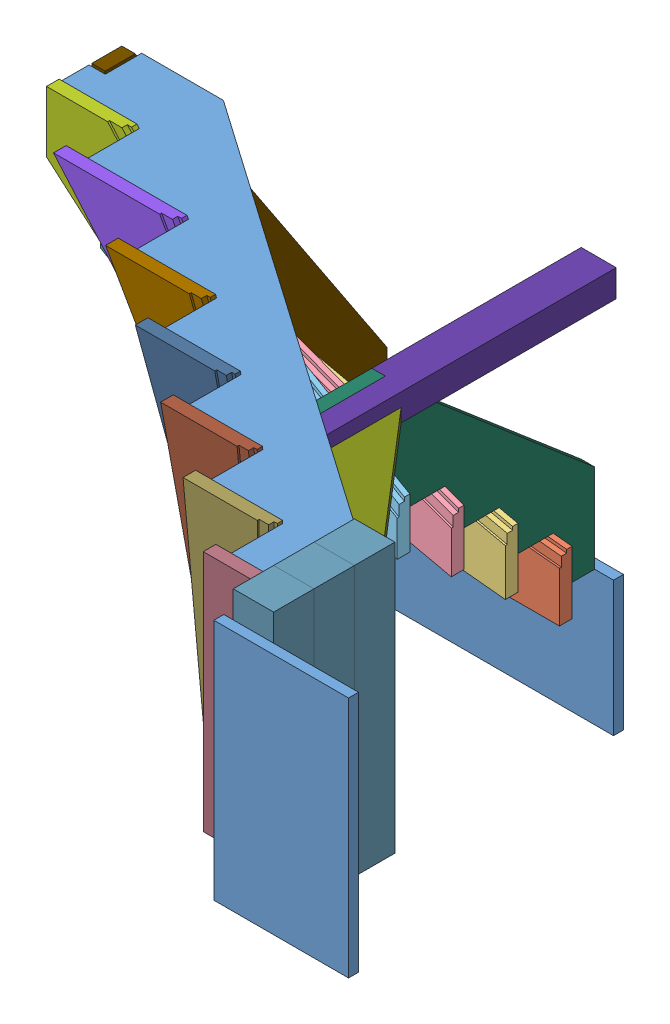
SolidWorks assembly Сборка1.SLDASM, configuration По умолчанию (file format 3100). Lengths in mm.
Overall size (2526.46 2339.46 2647.01).
22 component instances, 19 part files, 60 mates.
Components (placement in the parent):
- пол-1: пол.SLDPRT [По умолчанию] at (-122.0518 849.4502 0) size (900 500 37)
- ступень1-1: ступень1.SLDPRT [По умолчанию] at (-1022.0518 1074.7742 190.77) x (0 1 0) z (0 0 1) size (323.09 900 47)
- ступень2-1: ступень2.SLDPRT [По умолчанию] at (-1022.0518 1074.7742 391.54) x (0 1 0) z (0 0 1) size (422.42 900 47)
- ступень3-1: ступень3.SLDPRT [По умолчанию] at (-1022.0518 1074.7742 592.31) x (0 1 0) z (0 0 1) size (546.1 900 47)
- ступень4-1: ступень4.SLDPRT [По умолчанию] at (-1022.0518 1074.7742 793.08) x (0 1 0) z (0 0 1) size (704.65 900 47)
- ступень5-1: ступень5.SLDPRT [По умолчанию] at (-1022.0518 1074.7742 993.85) x (0 1 0) z (0 0 1) size (973.89 900 47)
- ступень6-1: ступень6.SLDPRT [По умолчанию] at (-1022.0518 1074.7742 1194.62) x (0 1 0) z (0 0 1) size (1006.49 1068.67 47)
- ступень7-1: ступень7.SLDPRT [По умолчанию] at (-1022.0518 1074.7742 1395.39) x (0 1 0) z (0 0 1) size (900 965.92 47)
- ступень8-1: ступень8.SLDPRT [По умолчанию] at (-1022.0518 1074.7742 1596.16) x (0 1 0) z (0 0 1) size (900 700.66 47)
- ступень9-1: ступень9.SLDPRT [По умолчанию] at (-1022.0518 1074.7742 1796.93) x (0 1 0) z (0 0 1) size (900 544.03 47)
- ступень10-1: ступень10.SLDPRT [По умолчанию] at (-1022.0518 1074.7742 1997.7) x (0 1 0) z (0 0 1) size (900 421.5 47)
- ступень11-1: ступень11.SLDPRT [По умолчанию] at (-1022.0518 1074.7742 2198.47) x (0 1 0) z (0 0 1) size (900 322.86 47)
- ступень12-1: ступень12.SLDPRT [По умолчанию] at (-1022.0518 1074.7742 2399.24) x (0 1 0) z (0 0 1) size (900 275 47)
- пол-2: пол.SLDPRT [По умолчанию] at (-509.7278 1074.7742 2610.01) x (0 1 0) z (0 0 1) size (900 500 37)
- брус_верх-1: брус_верх.SLDPRT [По умолчанию] at (1189.4089 394.4409 1114.2382) x (0 1 0) z (0 0 1) size (1000 150 150)
- брус_верх-2: брус_верх.SLDPRT [По умолчанию] at (1039.4089 955.1075 964.2382) x (0 -1 0) z (0 0 1) size (1000 150 150)
- брус_верх-3: брус_верх.SLDPRT [По умолчанию] at (1039.4089 955.1075 814.2382) x (0 -1 0) z (0 0 1) size (1000 150 150)
- тет_п_н-1: тет_п_н.SLDPRT [По умолчанию] at (-192.0518 -756.8585 2033.016) x (0 -1 0) z (-1 0 0) size (1222.98 1157.62 336.22)
- тет_п_в-1: тет_п_в.SLDPRT [По умолчанию] at (1455.2162 294.7742 3060.6451) x (1 0 0) z (0 -1 0) size (1231.46 1563.93 50)
- столб-1: столб.SLDPRT [По умолчанию] at (-159.3336 224.9653 37) x (-1 0 0) z (0 0 -1) size (130 100 1157.62)
- тет_л_н-2: тет_л_н.SLDPRT [По умолчанию] at (-962.0518 -1505.1984 470.2075) x (0 0 -1) z (-1 0 0) size (1157.62 1739.46 50)
- тет_л_в-1: тет_л_в.SLDPRT [По умолчанию] at (1455.2162 1064.7742 3022.5231) x (1 0 0) z (0 -1 0) size (2061.46 1450.95 50)
Mates (geometry in assembly coordinates):
- Расстояние1: distance = 200.77 mm aligned: plane of пол-1 through (-1022.0518 -664.6866 37) normal (0 0 1); plane of ступень1-1 through (-1022.0518 -711.6866 237.77) normal (0 0 1)
- Расстояние2: distance = 200.77 mm aligned: plane of ступень1-1 through (-1022.0518 -711.6866 237.77) normal (0 0 1); plane of ступень2-1 through (-1022.0518 -151.9642 438.54) normal (0 0 1)
- Совпадение4: coincident anti-aligned: plane of ступень1-1 through (-1022.0518 -435.8291 237.77) normal (0.099938 0.994994 0); plane of ступень2-1 through (-1022.0518 -435.8291 438.54) normal (-0.099938 -0.994994 0)
- Расстояние3: distance = 200.77 mm aligned: plane of ступень2-1 through (-1022.0518 -151.9642 438.54) normal (0 0 1); plane of ступень3-1 through (-1022.0518 142.9274 639.31) normal (0 0 1)
- Совпадение6: coincident anti-aligned: plane of ступень2-1 through (-1022.0518 -151.9642 438.54) normal (0.217944 0.975961 0); plane of ступень3-1 through (-1022.0518 -151.9642 639.31) normal (-0.217944 -0.975961 0)
- Расстояние4: distance = 200.77 mm aligned: plane of ступень3-1 through (-1022.0518 142.9274 639.31) normal (0 0 1); plane of ступень4-1 through (-122.0518 -63.7129 840.08) normal (0 0 1)
- Совпадение8: coincident anti-aligned: plane of ступень3-1 through (-1022.0518 142.9274 639.31) normal (0.352821 0.935691 0); plane of ступень4-1 through (-1022.0518 142.9274 840.08) normal (-0.352821 -0.935691 0)
- Расстояние5: distance = 200.77 mm aligned: plane of ступень4-1 through (-122.0518 -63.7129 840.08) normal (0 0 1); plane of ступень5-1 through (-1022.0518 847.9909 1040.85) normal (0 0 1)
- Совпадение10: coincident anti-aligned: plane of ступень4-1 through (-1022.0518 453.9939 840.08) normal (0.498621 0.86682 0); plane of ступень5-1 through (-1022.0518 453.9939 1040.85) normal (-0.498621 -0.86682 0)
- Расстояние6: distance = 200.77 mm aligned: plane of ступень5-1 through (-1022.0518 847.9909 1040.85) normal (0 0 1); plane of ступень6-1 through (-1022.0518 1074.7742 1241.62) normal (0 0 1)
- Совпадение12: coincident anti-aligned: plane of ступень5-1 through (-1022.0518 847.9909 1040.85) normal (0.654788 0.755812 0); plane of ступень6-1 through (-1022.0518 847.9909 1241.62) normal (-0.654788 -0.755812 0)
- Совпадение13: coincident aligned: plane of пол-1 through (-1022.0518 -664.6866 37) normal (-1 0 0); plane of ступень1-1 through (-1022.0518 -435.8291 237.77) normal (-1 0 0)
- Совпадение14: coincident aligned: plane of ступень1-1 through (-1022.0518 -435.8291 237.77) normal (-1 0 0); plane of ступень2-1 through (-1022.0518 -151.9642 438.54) normal (-1 0 0)
- Совпадение15: coincident aligned: plane of ступень2-1 through (-1022.0518 -151.9642 438.54) normal (-1 0 0); plane of ступень3-1 through (-1022.0518 142.9274 639.31) normal (-1 0 0)
- Совпадение16: coincident aligned: plane of ступень3-1 through (-1022.0518 142.9274 639.31) normal (-1 0 0); plane of ступень4-1 through (-1022.0518 453.9939 840.08) normal (-1 0 0)
- Совпадение17: coincident aligned: plane of ступень4-1 through (-1022.0518 453.9939 840.08) normal (-1 0 0); plane of ступень5-1 through (-1022.0518 847.9909 1040.85) normal (-1 0 0)
- Совпадение18: coincident aligned: plane of ступень5-1 through (-1022.0518 847.9909 1040.85) normal (-1 0 0); plane of ступень6-1 through (-1022.0518 1074.7742 1241.62) normal (-1 0 0)
- Совпадение19: coincident anti-aligned: plane of ступень6-1 through (-795.2686 1074.7742 1241.62) normal (0.755812 0.654788 0); plane of ступень7-1 through (-795.2686 1074.7742 1442.39) normal (-0.755812 -0.654788 0)
- Расстояние7: distance = 200.77 mm aligned: plane of ступень6-1 through (-1022.0518 1074.7742 1241.62) normal (0 0 1); plane of ступень7-1 through (-795.2686 1074.7742 1442.39) normal (0 0 1)
- Совпадение21: coincident aligned: plane of ступень6-1 through (-1022.0518 1074.7742 1241.62) normal (0 1 0); plane of ступень7-1 through (-795.2686 1074.7742 1442.39) normal (0 1 0)
- Совпадение22: coincident anti-aligned: plane of ступень7-1 through (-401.2715 1074.7742 1442.39) normal (0.86682 0.498621 0); plane of ступень8-1 through (-401.2715 1074.7742 1643.16) normal (-0.86682 -0.498621 0)
- Расстояние8: distance = 200.77 mm aligned: plane of ступень7-1 through (-795.2686 1074.7742 1442.39) normal (0 0 1); plane of ступень8-1 through (249.1578 174.7742 1643.16) normal (0 0 1)
- Совпадение24: coincident aligned: plane of ступень7-1 through (-795.2686 1074.7742 1442.39) normal (0 1 0); plane of ступень8-1 through (-401.2715 1074.7742 1643.16) normal (0 1 0)
- Совпадение25: coincident anti-aligned: plane of ступень8-1 through (-90.205 1074.7742 1643.16) normal (0.935691 0.352821 0); plane of ступень9-1 through (-90.205 1074.7742 1843.93) normal (-0.935691 -0.352821 0)
- Совпадение26: coincident aligned: plane of ступень8-1 through (-401.2715 1074.7742 1643.16) normal (0 1 0); plane of ступень9-1 through (-90.205 1074.7742 1843.93) normal (0 1 0)
- Расстояние9: distance = 200.77 mm aligned: plane of ступень8-1 through (249.1578 174.7742 1643.16) normal (0 0 1); plane of ступень9-1 through (-90.205 1074.7742 1843.93) normal (0 0 1)
- Совпадение28: coincident anti-aligned: plane of ступень9-1 through (204.6866 1074.7742 1843.93) normal (0.975961 0.217944 0); plane of ступень10-1 through (204.6866 1074.7742 2044.7) normal (-0.975961 -0.217944 0)
- Совпадение29: coincident aligned: plane of ступень9-1 through (-90.205 1074.7742 1843.93) normal (0 1 0); plane of ступень10-1 through (204.6866 1074.7742 2044.7) normal (0 1 0)
- Расстояние10: distance = 200.77 mm aligned: plane of ступень9-1 through (-90.205 1074.7742 1843.93) normal (0 0 1); plane of ступень10-1 through (204.6866 1074.7742 2044.7) normal (0 0 1)
- Совпадение31: coincident anti-aligned: plane of ступень10-1 through (488.5515 1074.7742 2044.7) normal (0.994994 0.099938 0); plane of ступень11-1 through (488.5515 1074.7742 2245.47) normal (-0.994994 -0.099938 0)
- Совпадение32: coincident aligned: plane of ступень10-1 through (204.6866 1074.7742 2044.7) normal (0 1 0); plane of ступень11-1 through (488.5515 1074.7742 2245.47) normal (0 1 0)
- Расстояние11: distance = 200.77 mm aligned: plane of ступень10-1 through (204.6866 1074.7742 2044.7) normal (0 0 1); plane of ступень11-1 through (764.4089 1074.7742 2245.47) normal (0 0 1)
- Совпадение34: coincident anti-aligned: plane of ступень11-1 through (764.4089 174.7742 2245.47) normal (1 0 0); plane of ступень12-1 through (764.4089 174.7742 2446.24) normal (-1 0 0)
- Совпадение35: coincident aligned: plane of ступень11-1 through (488.5515 1074.7742 2245.47) normal (0 1 0); plane of ступень12-1 through (764.4089 1074.7742 2446.24) normal (0 1 0)
- Расстояние12: distance = 200.77 mm aligned: plane of ступень11-1 through (764.4089 1074.7742 2245.47) normal (0 0 1); plane of ступень12-1 through (764.4089 174.7742 2446.24) normal (0 0 1)
- Совпадение37: coincident anti-aligned: plane of ступень12-1 through (1004.4089 1074.7742 2446.24) normal (1 0 0); plane of пол-2 through (1004.4089 174.7742 2647.01) normal (-1 0 0)
- Совпадение38: coincident aligned: plane of ступень12-1 through (764.4089 1074.7742 2446.24) normal (0 1 0); plane of пол-2 through (1004.4089 1074.7742 2647.01) normal (0 1 0)
- Расстояние13: distance = 200.77 mm aligned: plane of ступень12-1 through (764.4089 174.7742 2446.24) normal (0 0 1); plane of пол-2 through (1004.4089 174.7742 2647.01) normal (0 0 1)
- Совпадение39: coincident anti-aligned: plane of ступень12-1 through (1039.4089 174.7742 2439.24) normal (1 0 0); plane of брус_верх-1 through (1039.4089 174.7742 2460.01) normal (-1 0 0)
- Совпадение40: coincident anti-aligned: plane of пол-2 through (1004.4089 174.7742 2610.01) normal (0 0 -1); plane of брус_верх-1 through (1039.4089 174.7742 2610.01) normal (0 0 1)
- Совпадение41: coincident anti-aligned: plane of ступень12-1 through (1039.4089 174.7742 2439.24) normal (1 0 0); plane of брус_верх-2 through (1039.4089 1174.7742 2310.01) normal (-1 0 0)
- Совпадение42: coincident anti-aligned: plane of брус_верх-1 through (1039.4089 174.7742 2460.01) normal (0 0 -1); plane of брус_верх-2 through (1189.4089 1174.7742 2460.01) normal (0 0 1)
- Совпадение43: coincident anti-aligned: plane of ступень12-1 through (1039.4089 174.7742 2439.24) normal (1 0 0); plane of брус_верх-3 through (1039.4089 1174.7742 2160.01) normal (-1 0 0)
- Совпадение44: coincident anti-aligned: plane of брус_верх-2 through (1189.4089 1174.7742 2310.01) normal (0 0 -1); plane of брус_верх-3 through (1189.4089 1174.7742 2310.01) normal (0 0 1)
- Совпадение45: coincident aligned: plane of брус_верх-1 through (1039.4089 174.7742 2460.01) normal (0 -1 0); plane of брус_верх-2 through (1189.4089 174.7742 2310.01) normal (0 -1 0)
- Совпадение46: coincident aligned: plane of брус_верх-2 through (1189.4089 174.7742 2310.01) normal (0 -1 0); plane of брус_верх-3 through (1189.4089 174.7742 2160.01) normal (0 -1 0)
- Совпадение47: coincident aligned: plane of пол-2 through (1004.4089 174.7742 2647.01) normal (0 -1 0); plane of брус_верх-1 through (1039.4089 174.7742 2460.01) normal (0 -1 0)
- Расстояние14: distance = 70 mm aligned: plane of ступень1-1 through (-122.0518 -711.6866 237.77) normal (1 0 0); plane of тет_п_н-1 through (-192.0518 -119.8103 793.08) normal (1 0 0)
- Совпадение52: coincident anti-aligned: plane of ступень12-1 through (764.4089 174.7742 2399.24) normal (0 0 -1); plane of тет_п_в-1 through (1039.4089 244.7742 2399.24) normal (0 0 1)
- Совпадение53: coincident anti-aligned: plane of брус_верх-2 through (1039.4089 1174.7742 2310.01) normal (-1 0 0); plane of тет_п_в-1 through (1039.4089 244.7742 2399.24) normal (1 0 0)
- Расстояние15: distance = 70 mm aligned: plane of ступень12-1 through (764.4089 174.7742 2446.24) normal (0 -1 0); plane of тет_п_в-1 through (-112.0518 244.7742 835.3064) normal (0 -1 0)
- Совпадение59: coincident anti-aligned: plane of пол-1 through (-1022.0518 -664.6866 37) normal (0 0 1); plane of столб-1 through (-112.0518 244.7742 37) normal (0 0 -1)
- Совпадение60: coincident aligned: plane of тет_п_н-1 through (-242.0518 -119.8103 793.08) normal (-1 0 0); plane of столб-1 through (-242.0518 344.7742 1358.6322) normal (-1 0 0)
- Совпадение61: coincident aligned: plane of тет_п_в-1 through (-112.0518 244.7742 835.3064) normal (0 -1 0); plane of столб-1 through (-112.0518 244.7742 1358.6322) normal (0 -1 0)
- Расстояние17: distance = 47 mm anti-aligned: plane of пол-1 through (-1022.0518 -664.6866 37) normal (0 1 0); plane of ступень1-1 through (-1022.0518 -711.6866 237.77) normal (0 -1 0)
- Расстояние19: distance = 10 mm aligned: plane of ступень1-1 through (-1022.0518 -435.8291 237.77) normal (-1 0 0); plane of тет_л_н-2 through (-1012.0518 1074.7742 1083.62) normal (-1 0 0)
- Совпадение65: coincident anti-aligned: plane of пол-1 through (-1022.0518 -664.6866 37) normal (0 0 1); plane of тет_л_н-2 through (-1012.0518 -664.6866 37) normal (0 0 -1)
- Расстояние20: distance = 10 mm aligned: plane of ступень11-1 through (488.5515 1074.7742 2245.47) normal (0 1 0); plane of тет_л_в-1 through (-724.4204 1064.7742 902.676) normal (0 1 0)
- Совпадение67: coincident anti-aligned: plane of брус_верх-3 through (1039.4089 1174.7742 2160.01) normal (-1 0 0); plane of тет_л_в-1 through (1039.4089 1014.7742 2399.24) normal (1 0 0)
- Совпадение68: coincident anti-aligned: plane of ступень12-1 through (764.4089 174.7742 2399.24) normal (0 0 -1); plane of тет_л_в-1 through (1039.4089 1014.7742 2399.24) normal (0 0 1)
